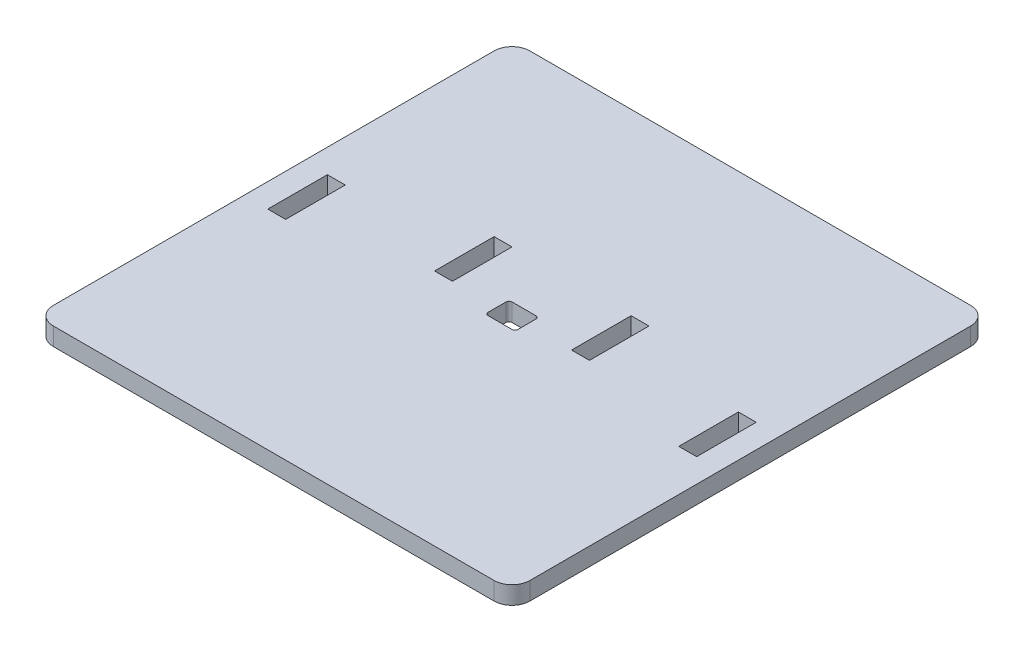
from build123d import *

# Parameters (mm, degrees)
SKETCH1_W               = 6
SKETCH1_H               = 20
BOSS_EXTRUDE1_DEPTH     = 6
SKETCH2_W               = 6
SKETCH2_H               = 20
CUT_EXTRUDE1_DEPTH      = 179.986032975
CUT_EXTRUDE2_DEPTH      = 179.986032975
CUT_EXTRUDE2_DEPTH_BACK = 179.986032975
SKETCH3_W               = 10
SKETCH3_H               = 8
FILLET1_R               = 1


with BuildPart() as part:
    # Sketch1 → Boss-Extrude1 (new body)
    with BuildSketch(Plane(origin=(0, 0, 0), x_dir=(1, 0, 0), z_dir=(0, 1, 0))):
        with BuildLine():
            Line((-74, 0), (74, 0))
            ThreePointArc((74, 0), (78.242640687, 1.757359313), (80, 6))
            Line((80, 6), (80, 154))
            ThreePointArc((80, 154), (78.242640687, 158.242640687), (74, 160))
            Line((74, 160), (-74, 160))
            ThreePointArc((-74, 160), (-78.242640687, 158.242640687), (-80, 154))
            Line((-80, 154), (-80, 6))
            ThreePointArc((-80, 6), (-78.242640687, 1.757359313), (-74, 0))
        make_face()
        with Locations((-69, 80)):
            Rectangle(SKETCH1_W, SKETCH1_H, mode=Mode.SUBTRACT)
        with Locations((69, 80)):
            Rectangle(SKETCH1_W, SKETCH1_H, mode=Mode.SUBTRACT)
    extrude(amount=BOSS_EXTRUDE1_DEPTH)

    # Sketch2 → Cut-Extrude1 (cut, through all)
    with BuildSketch(Plane(origin=(0, 6, 0), x_dir=(1, 0, 0), z_dir=(0, 1, 0))):
        with Locations((23, 90)):
            Rectangle(SKETCH2_W, SKETCH2_H)
        with Locations((-23, 90)):
            Rectangle(SKETCH2_W, SKETCH2_H)
    extrude(amount=-CUT_EXTRUDE1_DEPTH, mode=Mode.SUBTRACT)

    # Sketch3 → Cut-Extrude2 (cut, two sides: drawn at the far end of the back side and taken through both)
    with BuildSketch(Plane(origin=(0, 6, 0), x_dir=(1, 0, 0), z_dir=(0, 1, 0)).offset(-CUT_EXTRUDE2_DEPTH_BACK)):
        with Locations((0, 80)):
            Rectangle(SKETCH3_W, SKETCH3_H)
    extrude(amount=CUT_EXTRUDE2_DEPTH + CUT_EXTRUDE2_DEPTH_BACK, mode=Mode.SUBTRACT)

    # Fillet1
    fillet1_edges = [part.edges().sort_by_distance(p)[0] for p in [
        (5, 3, -84),
        (5, 3, -76),
        (-5, 3, -76),
        (-5, 3, -84),
    ]]
    fillet(fillet1_edges, radius=FILLET1_R)


solid = part.part
